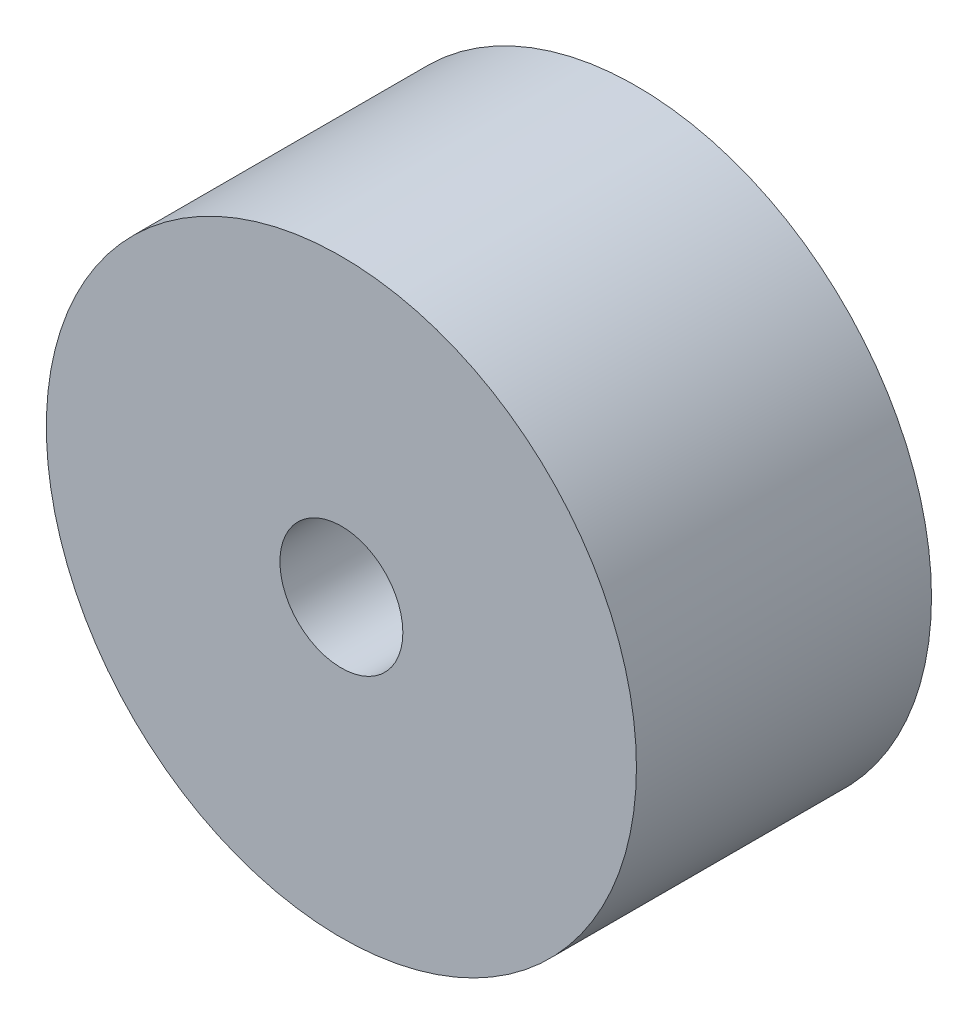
ISO-10303-21;
HEADER;
FILE_DESCRIPTION(('STEP AP214'),'2;1');
FILE_NAME('part.step','',(''),(''),'','','');
FILE_SCHEMA(('AUTOMOTIVE_DESIGN { 1 0 10303 214 1 1 1 1 }'));
ENDSEC;
DATA;
#1=APPLICATION_CONTEXT('core data for automotive mechanical design processes');
#2=APPLICATION_PROTOCOL_DEFINITION('international standard','automotive_design',2000,#1);
#3=PRODUCT_CONTEXT('',#1,'mechanical');
#4=PRODUCT('Part','Part','',(#3));
#5=PRODUCT_RELATED_PRODUCT_CATEGORY('part','',(#4));
#6=PRODUCT_DEFINITION_FORMATION('','',#4);
#7=PRODUCT_DEFINITION_CONTEXT('part definition',#1,'design');
#8=PRODUCT_DEFINITION('design','',#6,#7);
#9=PRODUCT_DEFINITION_SHAPE('','',#8);
#10=(LENGTH_UNIT() NAMED_UNIT(*) SI_UNIT(.MILLI.,.METRE.));
#11=(NAMED_UNIT(*) PLANE_ANGLE_UNIT() SI_UNIT($,.RADIAN.));
#12=(NAMED_UNIT(*) SI_UNIT($,.STERADIAN.) SOLID_ANGLE_UNIT());
#13=UNCERTAINTY_MEASURE_WITH_UNIT(LENGTH_MEASURE(1.E-05),#10,'distance_accuracy_value','');
#14=(GEOMETRIC_REPRESENTATION_CONTEXT(3) GLOBAL_UNCERTAINTY_ASSIGNED_CONTEXT((#13)) GLOBAL_UNIT_ASSIGNED_CONTEXT((#10,
#11,#12)) REPRESENTATION_CONTEXT('',''));
#15=CARTESIAN_POINT('',(0.,0.,0.));
#16=DIRECTION('',(0.,0.,1.));
#17=DIRECTION('',(1.,0.,0.));
#18=AXIS2_PLACEMENT_3D('',#15,#16,#17);
#19=CARTESIAN_POINT('',(0.,0.,6.));
#20=DIRECTION('',(0.,0.,1.));
#21=DIRECTION('',(1.,0.,0.));
#22=AXIS2_PLACEMENT_3D('',#19,#20,#21);
#23=PLANE('',#22);
#24=CARTESIAN_POINT('',(0.,0.,6.));
#25=DIRECTION('',(0.,0.,1.));
#26=DIRECTION('',(1.,0.,0.));
#27=AXIS2_PLACEMENT_3D('',#24,#25,#26);
#28=CIRCLE('',#27,6.);
#29=CARTESIAN_POINT('',(6.,0.,6.));
#30=VERTEX_POINT('',#29);
#31=EDGE_CURVE('E10',#30,#30,#28,.T.);
#32=ORIENTED_EDGE('',*,*,#31,.T.);
#33=EDGE_LOOP('',(#32));
#34=FACE_BOUND('',#33,.T.);
#35=CARTESIAN_POINT('',(0.,0.,6.));
#36=DIRECTION('',(0.,0.,1.));
#37=DIRECTION('',(1.,0.,0.));
#38=AXIS2_PLACEMENT_3D('',#35,#36,#37);
#39=CIRCLE('',#38,1.25);
#40=CARTESIAN_POINT('',(1.25,0.,6.));
#41=VERTEX_POINT('',#40);
#42=EDGE_CURVE('E56',#41,#41,#39,.T.);
#43=ORIENTED_EDGE('',*,*,#42,.F.);
#44=EDGE_LOOP('',(#43));
#45=FACE_BOUND('',#44,.T.);
#46=ADVANCED_FACE('F43',(#34,#45),#23,.T.);
#47=CARTESIAN_POINT('',(0.,0.,0.));
#48=DIRECTION('',(0.,0.,1.));
#49=DIRECTION('',(1.,0.,0.));
#50=AXIS2_PLACEMENT_3D('',#47,#48,#49);
#51=PLANE('',#50);
#52=CARTESIAN_POINT('',(0.,0.,0.));
#53=DIRECTION('',(0.,0.,1.));
#54=DIRECTION('',(1.,0.,0.));
#55=AXIS2_PLACEMENT_3D('',#52,#53,#54);
#56=CIRCLE('',#55,6.);
#57=CARTESIAN_POINT('',(6.,0.,0.));
#58=VERTEX_POINT('',#57);
#59=EDGE_CURVE('E47',#58,#58,#56,.T.);
#60=ORIENTED_EDGE('',*,*,#59,.F.);
#61=EDGE_LOOP('',(#60));
#62=FACE_BOUND('',#61,.T.);
#63=CARTESIAN_POINT('',(0.,0.,0.));
#64=DIRECTION('',(0.,0.,1.));
#65=DIRECTION('',(1.,0.,0.));
#66=AXIS2_PLACEMENT_3D('',#63,#64,#65);
#67=CIRCLE('',#66,1.25);
#68=CARTESIAN_POINT('',(1.25,0.,0.));
#69=VERTEX_POINT('',#68);
#70=EDGE_CURVE('E58',#69,#69,#67,.T.);
#71=ORIENTED_EDGE('',*,*,#70,.T.);
#72=EDGE_LOOP('',(#71));
#73=FACE_BOUND('',#72,.T.);
#74=ADVANCED_FACE('F70',(#62,#73),#51,.F.);
#75=CARTESIAN_POINT('',(0.,0.,6.));
#76=DIRECTION('',(0.,0.,-1.));
#77=DIRECTION('',(-1.,0.,0.));
#78=AXIS2_PLACEMENT_3D('',#75,#76,#77);
#79=CYLINDRICAL_SURFACE('',#78,6.);
#80=ORIENTED_EDGE('',*,*,#31,.F.);
#81=EDGE_LOOP('',(#80));
#82=FACE_BOUND('',#81,.T.);
#83=ORIENTED_EDGE('',*,*,#59,.T.);
#84=EDGE_LOOP('',(#83));
#85=FACE_BOUND('',#84,.T.);
#86=ADVANCED_FACE('F45',(#82,#85),#79,.T.);
#87=CARTESIAN_POINT('',(0.,0.,6.));
#88=DIRECTION('',(0.,0.,-1.));
#89=DIRECTION('',(-1.,0.,0.));
#90=AXIS2_PLACEMENT_3D('',#87,#88,#89);
#91=CYLINDRICAL_SURFACE('',#90,1.25);
#92=ORIENTED_EDGE('',*,*,#42,.T.);
#93=EDGE_LOOP('',(#92));
#94=FACE_BOUND('',#93,.T.);
#95=ORIENTED_EDGE('',*,*,#70,.F.);
#96=EDGE_LOOP('',(#95));
#97=FACE_BOUND('',#96,.T.);
#98=ADVANCED_FACE('F66',(#94,#97),#91,.F.);
#99=CLOSED_SHELL('',(#46,#74,#86,#98));
#100=MANIFOLD_SOLID_BREP('B2',#99);
#101=ADVANCED_BREP_SHAPE_REPRESENTATION('',(#18,#100),#14);
#102=SHAPE_DEFINITION_REPRESENTATION(#9,#101);
ENDSEC;
END-ISO-10303-21;
